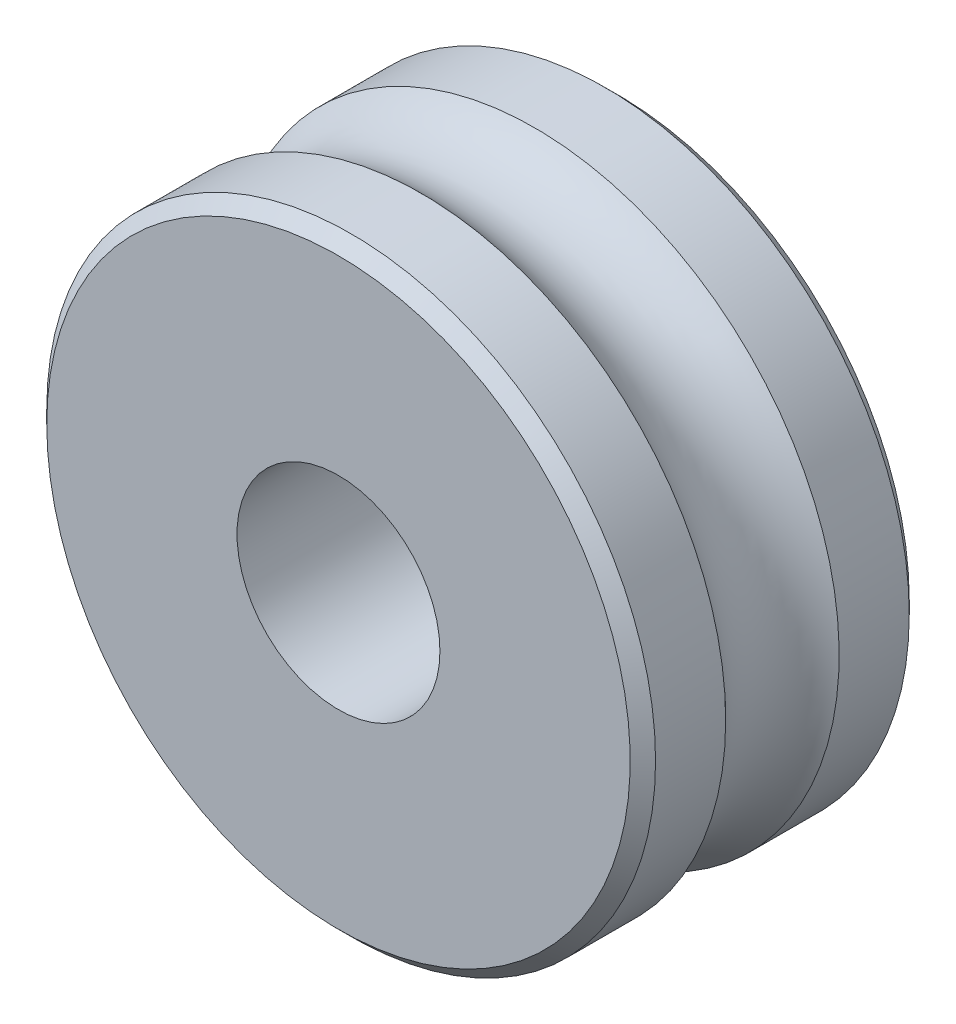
ISO-10303-21;
HEADER;
FILE_DESCRIPTION(('STEP AP214'),'2;1');
FILE_NAME('part.step','',(''),(''),'','','');
FILE_SCHEMA(('AUTOMOTIVE_DESIGN { 1 0 10303 214 1 1 1 1 }'));
ENDSEC;
DATA;
#1=APPLICATION_CONTEXT('core data for automotive mechanical design processes');
#2=APPLICATION_PROTOCOL_DEFINITION('international standard','automotive_design',2000,#1);
#3=PRODUCT_CONTEXT('',#1,'mechanical');
#4=PRODUCT('Part','Part','',(#3));
#5=PRODUCT_RELATED_PRODUCT_CATEGORY('part','',(#4));
#6=PRODUCT_DEFINITION_FORMATION('','',#4);
#7=PRODUCT_DEFINITION_CONTEXT('part definition',#1,'design');
#8=PRODUCT_DEFINITION('design','',#6,#7);
#9=PRODUCT_DEFINITION_SHAPE('','',#8);
#10=(LENGTH_UNIT() NAMED_UNIT(*) SI_UNIT(.MILLI.,.METRE.));
#11=(NAMED_UNIT(*) PLANE_ANGLE_UNIT() SI_UNIT($,.RADIAN.));
#12=(NAMED_UNIT(*) SI_UNIT($,.STERADIAN.) SOLID_ANGLE_UNIT());
#13=UNCERTAINTY_MEASURE_WITH_UNIT(LENGTH_MEASURE(1.E-05),#10,'distance_accuracy_value','');
#14=(GEOMETRIC_REPRESENTATION_CONTEXT(3) GLOBAL_UNCERTAINTY_ASSIGNED_CONTEXT((#13)) GLOBAL_UNIT_ASSIGNED_CONTEXT((#10,
#11,#12)) REPRESENTATION_CONTEXT('',''));
#15=CARTESIAN_POINT('',(0.,0.,0.));
#16=DIRECTION('',(0.,0.,1.));
#17=DIRECTION('',(1.,0.,0.));
#18=AXIS2_PLACEMENT_3D('',#15,#16,#17);
#19=CARTESIAN_POINT('',(0.,0.,-3.86803398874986));
#20=DIRECTION('',(0.,0.,-1.));
#21=DIRECTION('',(-1.,0.,0.));
#22=AXIS2_PLACEMENT_3D('',#19,#20,#21);
#23=CYLINDRICAL_SURFACE('',#22,12.);
#24=CARTESIAN_POINT('',(0.,0.,-4.99999999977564));
#25=DIRECTION('',(0.,0.,1.));
#26=DIRECTION('',(-1.,0.,0.));
#27=AXIS2_PLACEMENT_3D('',#24,#25,#26);
#28=CIRCLE('',#27,11.9999999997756);
#29=CARTESIAN_POINT('',(-11.9999999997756,0.,-4.99999999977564));
#30=VERTEX_POINT('',#29);
#31=EDGE_CURVE('E47',#30,#30,#28,.F.);
#32=ORIENTED_EDGE('',*,*,#31,.F.);
#33=EDGE_LOOP('',(#32));
#34=FACE_BOUND('',#33,.T.);
#35=CARTESIAN_POINT('',(0.,0.,-2.23606797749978));
#36=DIRECTION('',(0.,0.,1.));
#37=DIRECTION('',(0.,-1.,0.));
#38=AXIS2_PLACEMENT_3D('',#35,#36,#37);
#39=CIRCLE('',#38,12.);
#40=CARTESIAN_POINT('',(0.,-12.,-2.23606797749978));
#41=VERTEX_POINT('',#40);
#42=EDGE_CURVE('E52',#41,#41,#39,.T.);
#43=ORIENTED_EDGE('',*,*,#42,.F.);
#44=EDGE_LOOP('',(#43));
#45=FACE_BOUND('',#44,.T.);
#46=ADVANCED_FACE('F14',(#34,#45),#23,.T.);
#47=CARTESIAN_POINT('',(0.,0.,0.));
#48=DIRECTION('',(0.,0.,-1.));
#49=DIRECTION('',(-1.,0.,0.));
#50=AXIS2_PLACEMENT_3D('',#47,#48,#49);
#51=TOROIDAL_SURFACE('',#50,14.,2.99999999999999);
#52=CARTESIAN_POINT('',(0.,0.,2.23606797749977));
#53=DIRECTION('',(0.,0.,-1.));
#54=DIRECTION('',(-1.,0.,0.));
#55=AXIS2_PLACEMENT_3D('',#52,#53,#54);
#56=CIRCLE('',#55,12.);
#57=CARTESIAN_POINT('',(-12.,0.,2.23606797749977));
#58=VERTEX_POINT('',#57);
#59=EDGE_CURVE('E41',#58,#58,#56,.F.);
#60=ORIENTED_EDGE('',*,*,#59,.F.);
#61=EDGE_LOOP('',(#60));
#62=FACE_BOUND('',#61,.T.);
#63=ORIENTED_EDGE('',*,*,#42,.T.);
#64=EDGE_LOOP('',(#63));
#65=FACE_BOUND('',#64,.T.);
#66=ADVANCED_FACE('F16',(#62,#65),#51,.F.);
#67=CARTESIAN_POINT('',(0.,0.,-4.99999999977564));
#68=DIRECTION('',(0.,0.,1.));
#69=DIRECTION('',(1.,0.,0.));
#70=AXIS2_PLACEMENT_3D('',#67,#68,#69);
#71=CONICAL_SURFACE('',#70,11.9999999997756,0.7853981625);
#72=CARTESIAN_POINT('',(0.,0.,-5.50000000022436));
#73=DIRECTION('',(0.,0.,1.));
#74=DIRECTION('',(1.,0.,0.));
#75=AXIS2_PLACEMENT_3D('',#72,#73,#74);
#76=CIRCLE('',#75,11.5000000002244);
#77=CARTESIAN_POINT('',(11.5000000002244,0.,-5.50000000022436));
#78=VERTEX_POINT('',#77);
#79=EDGE_CURVE('E18',#78,#78,#76,.F.);
#80=ORIENTED_EDGE('',*,*,#79,.F.);
#81=EDGE_LOOP('',(#80));
#82=FACE_BOUND('',#81,.T.);
#83=ORIENTED_EDGE('',*,*,#31,.T.);
#84=EDGE_LOOP('',(#83));
#85=FACE_BOUND('',#84,.T.);
#86=ADVANCED_FACE('F64',(#82,#85),#71,.T.);
#87=CARTESIAN_POINT('',(0.,0.,3.86803398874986));
#88=DIRECTION('',(0.,0.,-1.));
#89=DIRECTION('',(-1.,0.,0.));
#90=AXIS2_PLACEMENT_3D('',#87,#88,#89);
#91=CYLINDRICAL_SURFACE('',#90,12.);
#92=CARTESIAN_POINT('',(0.,0.,4.99999999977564));
#93=DIRECTION('',(0.,0.,-1.));
#94=DIRECTION('',(-1.,0.,0.));
#95=AXIS2_PLACEMENT_3D('',#92,#93,#94);
#96=CIRCLE('',#95,11.9999999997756);
#97=CARTESIAN_POINT('',(-11.9999999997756,0.,4.99999999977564));
#98=VERTEX_POINT('',#97);
#99=EDGE_CURVE('E33',#98,#98,#96,.F.);
#100=ORIENTED_EDGE('',*,*,#99,.F.);
#101=EDGE_LOOP('',(#100));
#102=FACE_BOUND('',#101,.T.);
#103=ORIENTED_EDGE('',*,*,#59,.T.);
#104=EDGE_LOOP('',(#103));
#105=FACE_BOUND('',#104,.T.);
#106=ADVANCED_FACE('F85',(#102,#105),#91,.T.);
#107=CARTESIAN_POINT('',(6.,0.,-5.5));
#108=DIRECTION('',(0.,0.,-1.));
#109=DIRECTION('',(-1.,0.,0.));
#110=AXIS2_PLACEMENT_3D('',#107,#108,#109);
#111=PLANE('',#110);
#112=CARTESIAN_POINT('',(0.,0.,-5.5));
#113=DIRECTION('',(0.,0.,1.));
#114=DIRECTION('',(1.,0.,0.));
#115=AXIS2_PLACEMENT_3D('',#112,#113,#114);
#116=CIRCLE('',#115,4.);
#117=CARTESIAN_POINT('',(4.,0.,-5.5));
#118=VERTEX_POINT('',#117);
#119=EDGE_CURVE('E27',#118,#118,#116,.T.);
#120=ORIENTED_EDGE('',*,*,#119,.T.);
#121=EDGE_LOOP('',(#120));
#122=FACE_BOUND('',#121,.T.);
#123=ORIENTED_EDGE('',*,*,#79,.T.);
#124=EDGE_LOOP('',(#123));
#125=FACE_BOUND('',#124,.T.);
#126=ADVANCED_FACE('F82',(#122,#125),#111,.T.);
#127=CARTESIAN_POINT('',(0.,0.,4.99999999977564));
#128=DIRECTION('',(0.,0.,-1.));
#129=DIRECTION('',(-1.,0.,0.));
#130=AXIS2_PLACEMENT_3D('',#127,#128,#129);
#131=CONICAL_SURFACE('',#130,11.9999999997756,0.785398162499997);
#132=ORIENTED_EDGE('',*,*,#99,.T.);
#133=EDGE_LOOP('',(#132));
#134=FACE_BOUND('',#133,.T.);
#135=CARTESIAN_POINT('',(0.,0.,5.50000000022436));
#136=DIRECTION('',(0.,0.,-1.));
#137=DIRECTION('',(-1.,0.,0.));
#138=AXIS2_PLACEMENT_3D('',#135,#136,#137);
#139=CIRCLE('',#138,11.5000000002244);
#140=CARTESIAN_POINT('',(-11.5000000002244,0.,5.50000000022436));
#141=VERTEX_POINT('',#140);
#142=EDGE_CURVE('E22',#141,#141,#139,.F.);
#143=ORIENTED_EDGE('',*,*,#142,.F.);
#144=EDGE_LOOP('',(#143));
#145=FACE_BOUND('',#144,.T.);
#146=ADVANCED_FACE('F75',(#134,#145),#131,.T.);
#147=CARTESIAN_POINT('',(0.,0.,-5.5));
#148=DIRECTION('',(0.,0.,1.));
#149=DIRECTION('',(1.,0.,0.));
#150=AXIS2_PLACEMENT_3D('',#147,#148,#149);
#151=CYLINDRICAL_SURFACE('',#150,4.);
#152=ORIENTED_EDGE('',*,*,#119,.F.);
#153=EDGE_LOOP('',(#152));
#154=FACE_BOUND('',#153,.T.);
#155=CARTESIAN_POINT('',(0.,0.,5.5));
#156=DIRECTION('',(0.,0.,1.));
#157=DIRECTION('',(1.,0.,0.));
#158=AXIS2_PLACEMENT_3D('',#155,#156,#157);
#159=CIRCLE('',#158,4.);
#160=CARTESIAN_POINT('',(4.,0.,5.5));
#161=VERTEX_POINT('',#160);
#162=EDGE_CURVE('E10',#161,#161,#159,.F.);
#163=ORIENTED_EDGE('',*,*,#162,.F.);
#164=EDGE_LOOP('',(#163));
#165=FACE_BOUND('',#164,.T.);
#166=ADVANCED_FACE('F70',(#154,#165),#151,.F.);
#167=CARTESIAN_POINT('',(6.,0.,5.5));
#168=DIRECTION('',(0.,0.,1.));
#169=DIRECTION('',(1.,0.,0.));
#170=AXIS2_PLACEMENT_3D('',#167,#168,#169);
#171=PLANE('',#170);
#172=ORIENTED_EDGE('',*,*,#162,.T.);
#173=EDGE_LOOP('',(#172));
#174=FACE_BOUND('',#173,.T.);
#175=ORIENTED_EDGE('',*,*,#142,.T.);
#176=EDGE_LOOP('',(#175));
#177=FACE_BOUND('',#176,.T.);
#178=ADVANCED_FACE('F68',(#174,#177),#171,.T.);
#179=CLOSED_SHELL('',(#46,#66,#86,#106,#126,#146,#166,#178));
#180=MANIFOLD_SOLID_BREP('B1',#179);
#181=ADVANCED_BREP_SHAPE_REPRESENTATION('',(#18,#180),#14);
#182=SHAPE_DEFINITION_REPRESENTATION(#9,#181);
ENDSEC;
END-ISO-10303-21;
